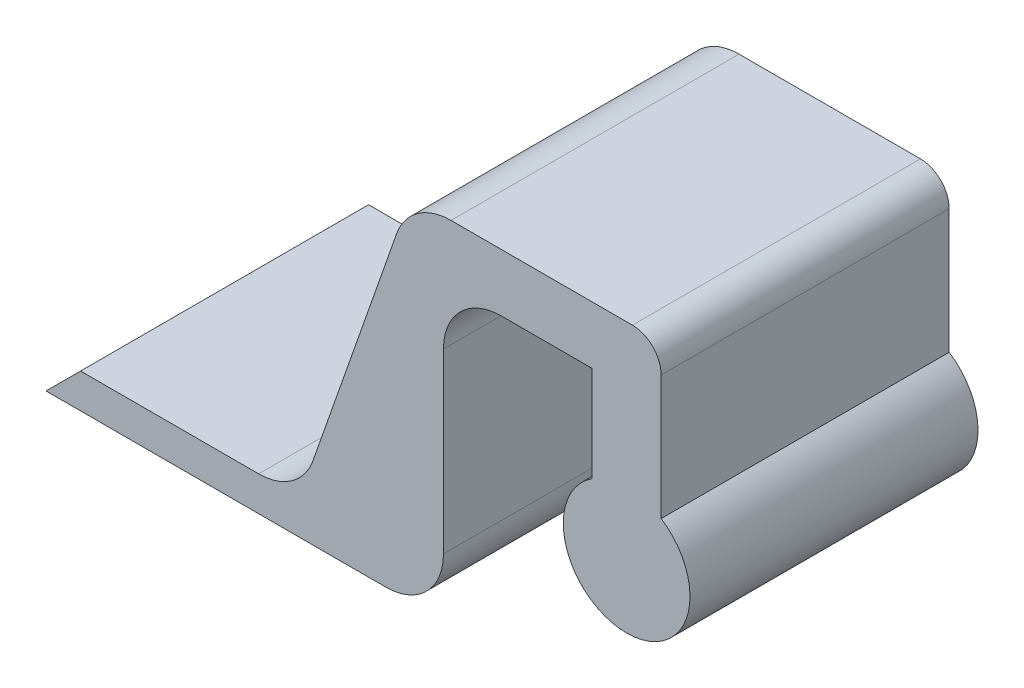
from build123d import *

# Parameters (mm, degrees)
SKETCH1_R           = 5.5
BOSS_EXTRUDE1_DEPTH = 25
FILLET6_R           = 5
FILLET2_R           = 5
FILLET3_R           = 5
FILLET4_R           = 2.5
FILLET5_R           = 5


with BuildPart() as part:
    # Sketch1 → Boss-Extrude1 (new body)
    with BuildSketch(Plane.XY):
        with BuildLine():
            Line((-3, 12.9), (-3, 4.609772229))
            ThreePointArc((-3, 4.609772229), (0, 5.5), (3, 4.609772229))
            Line((3, 4.609772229), (3, 12.9))
            Line((3, 12.9), (3, 17.9))
            Line((3, 17.9), (-18.786751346, 17.9))
            Line((-18.786751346, 17.9), (-28.4, -9.5))
            Line((-28.4, -9.5), (-47.4, -9.5))
            Line((-47.4, -9.5), (-50.4, -12.5))
            Line((-50.4, -12.5), (-15.9, -12.5))
            Line((-15.9, -12.5), (-15.9, 12.9))
            Line((-15.9, 12.9), (-3, 12.9))
        make_face()
        Circle(SKETCH1_R)
    extrude(amount=BOSS_EXTRUDE1_DEPTH)

    # Fillet6
    fillet6_edges = [part.edges().sort_by_distance(p)[0] for p in [
        (-28.4, -9.5, 12.5),
    ]]
    fillet(fillet6_edges, radius=FILLET6_R)

    # Fillet2
    fillet2_edges = [part.edges().sort_by_distance(p)[0] for p in [
        (-15.9, -12.5, 12.5),
    ]]
    fillet(fillet2_edges, radius=FILLET2_R)

    # Fillet3
    fillet3_edges = [part.edges().sort_by_distance(p)[0] for p in [
        (-18.786751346, 17.9, 12.5),
    ]]
    fillet(fillet3_edges, radius=FILLET3_R)

    # Fillet4
    fillet4_edges = [part.edges().sort_by_distance(p)[0] for p in [
        (3, 17.9, 12.5),
    ]]
    fillet(fillet4_edges, radius=FILLET4_R)

    # Fillet5
    fillet5_edges = [part.edges().sort_by_distance(p)[0] for p in [
        (-15.9, 12.9, 12.5),
    ]]
    fillet(fillet5_edges, radius=FILLET5_R)


solid = part.part
